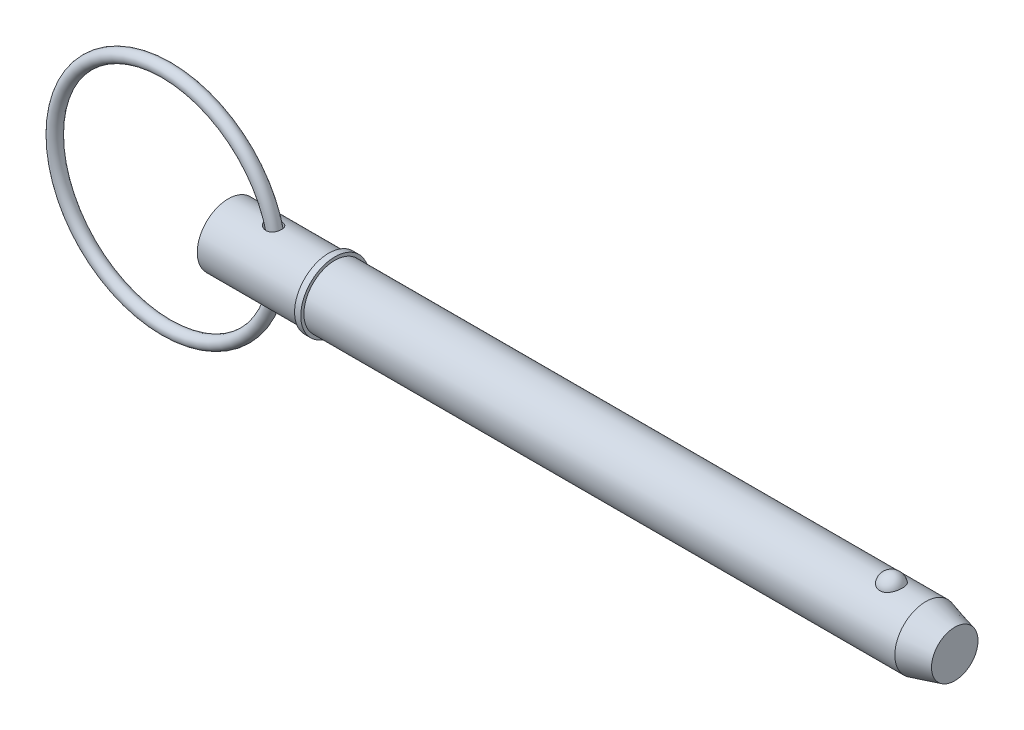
ISO-10303-21;
HEADER;
FILE_DESCRIPTION(('STEP AP214'),'2;1');
FILE_NAME('part.step','',(''),(''),'','','');
FILE_SCHEMA(('AUTOMOTIVE_DESIGN { 1 0 10303 214 1 1 1 1 }'));
ENDSEC;
DATA;
#1=APPLICATION_CONTEXT('core data for automotive mechanical design processes');
#2=APPLICATION_PROTOCOL_DEFINITION('international standard','automotive_design',2000,#1);
#3=PRODUCT_CONTEXT('',#1,'mechanical');
#4=PRODUCT('Part','Part','',(#3));
#5=PRODUCT_RELATED_PRODUCT_CATEGORY('part','',(#4));
#6=PRODUCT_DEFINITION_FORMATION('','',#4);
#7=PRODUCT_DEFINITION_CONTEXT('part definition',#1,'design');
#8=PRODUCT_DEFINITION('design','',#6,#7);
#9=PRODUCT_DEFINITION_SHAPE('','',#8);
#10=(LENGTH_UNIT() NAMED_UNIT(*) SI_UNIT(.MILLI.,.METRE.));
#11=(NAMED_UNIT(*) PLANE_ANGLE_UNIT() SI_UNIT($,.RADIAN.));
#12=(NAMED_UNIT(*) SI_UNIT($,.STERADIAN.) SOLID_ANGLE_UNIT());
#13=UNCERTAINTY_MEASURE_WITH_UNIT(LENGTH_MEASURE(1.E-05),#10,'distance_accuracy_value','');
#14=(GEOMETRIC_REPRESENTATION_CONTEXT(3) GLOBAL_UNCERTAINTY_ASSIGNED_CONTEXT((#13)) GLOBAL_UNIT_ASSIGNED_CONTEXT((#10,
#11,#12)) REPRESENTATION_CONTEXT('',''));
#15=CARTESIAN_POINT('',(0.,0.,0.));
#16=DIRECTION('',(0.,0.,1.));
#17=DIRECTION('',(1.,0.,0.));
#18=AXIS2_PLACEMENT_3D('',#15,#16,#17);
#19=CARTESIAN_POINT('',(-15.855506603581,0.,0.));
#20=DIRECTION('',(0.,0.,1.));
#21=DIRECTION('',(1.,0.,0.));
#22=AXIS2_PLACEMENT_3D('',#19,#20,#21);
#23=TOROIDAL_SURFACE('',#22,28.575,1.588);
#24=CARTESIAN_POINT('',(14.307493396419,0.,0.));
#25=VERTEX_POINT('',#24);
#26=VERTEX_LOOP('',#25);
#27=FACE_BOUND('',#26,.T.);
#28=ADVANCED_FACE('P0_F12',(#27),#23,.T.);
#29=CLOSED_SHELL('',(#28));
#30=MANIFOLD_SOLID_BREP('P0_B1',#29);
#31=CARTESIAN_POINT('',(0.,0.,0.));
#32=DIRECTION('',(1.,0.,0.));
#33=DIRECTION('',(0.,0.,-1.));
#34=AXIS2_PLACEMENT_3D('',#31,#32,#33);
#35=CYLINDRICAL_SURFACE('',#34,7.94);
#36=CARTESIAN_POINT('',(9.9064878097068,7.8609270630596,-1.11777712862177));
#37=CARTESIAN_POINT('',(9.98046148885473,7.84701054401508,-1.21564239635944));
#38=CARTESIAN_POINT('',(10.0632949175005,7.83217804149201,-1.30680329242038));
#39=CARTESIAN_POINT('',(10.243327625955,7.80247884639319,-1.47382688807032));
#40=CARTESIAN_POINT('',(10.3405572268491,7.78761214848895,-1.54965647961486));
#41=CARTESIAN_POINT('',(10.5460150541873,7.75960959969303,-1.6842723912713));
#42=CARTESIAN_POINT('',(10.654212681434,7.74646915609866,-1.74310445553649));
#43=CARTESIAN_POINT('',(10.8789333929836,7.72340979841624,-1.84259563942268));
#44=CARTESIAN_POINT('',(10.9954527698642,7.71348946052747,-1.88326279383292));
#45=CARTESIAN_POINT('',(11.2371543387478,7.69793327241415,-1.94589519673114));
#46=CARTESIAN_POINT('',(11.3624861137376,7.69242163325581,-1.96732022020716));
#47=CARTESIAN_POINT('',(11.6151110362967,7.68708151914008,-1.98809161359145));
#48=CARTESIAN_POINT('',(11.7424035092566,7.68725113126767,-1.98744541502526));
#49=CARTESIAN_POINT('',(11.9871377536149,7.69329740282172,-1.96389977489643));
#50=CARTESIAN_POINT('',(12.1047148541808,7.69883374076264,-1.94232728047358));
#51=CARTESIAN_POINT('',(12.3339179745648,7.7145667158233,-1.87886184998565));
#52=CARTESIAN_POINT('',(12.4455463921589,7.72476145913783,-1.83697717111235));
#53=CARTESIAN_POINT('',(12.6521036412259,7.74778151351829,-1.73721211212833));
#54=CARTESIAN_POINT('',(12.7476463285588,7.76039274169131,-1.68054854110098));
#55=CARTESIAN_POINT('',(12.9274536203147,7.78715828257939,-1.55179691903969));
#56=CARTESIAN_POINT('',(13.0117191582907,7.80131246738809,-1.47971014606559));
#57=CARTESIAN_POINT('',(13.16544092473,7.82932755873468,-1.32341211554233));
#58=CARTESIAN_POINT('',(13.2351086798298,7.84318958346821,-1.23940873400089));
#59=CARTESIAN_POINT('',(13.3595610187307,7.86933512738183,-1.06080152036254));
#60=CARTESIAN_POINT('',(13.4143450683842,7.88161858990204,-0.966197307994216));
#61=CARTESIAN_POINT('',(13.5082288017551,7.90340571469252,-0.767990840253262));
#62=CARTESIAN_POINT('',(13.5471601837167,7.91287927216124,-0.664305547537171));
#63=CARTESIAN_POINT('',(13.6076213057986,7.92785679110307,-0.451705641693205));
#64=CARTESIAN_POINT('',(13.6291504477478,7.93336061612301,-0.3427908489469));
#65=CARTESIAN_POINT('',(13.6544025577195,7.93983472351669,-0.122042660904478));
#66=CARTESIAN_POINT('',(13.6580055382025,7.94077445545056,-0.0101946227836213));
#67=CARTESIAN_POINT('',(13.6469977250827,7.93793630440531,0.212542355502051));
#68=CARTESIAN_POINT('',(13.6323866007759,7.93415833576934,0.323431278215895));
#69=CARTESIAN_POINT('',(13.5852649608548,7.92228583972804,0.541194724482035));
#70=CARTESIAN_POINT('',(13.5527398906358,7.91418780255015,0.648065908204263));
#71=CARTESIAN_POINT('',(13.4705326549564,7.8945509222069,0.854658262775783));
#72=CARTESIAN_POINT('',(13.4208502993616,7.88301204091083,0.954379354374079));
#73=CARTESIAN_POINT('',(13.3056021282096,7.85778224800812,1.14366619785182));
#74=CARTESIAN_POINT('',(13.2400609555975,7.8440946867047,1.23324739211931));
#75=CARTESIAN_POINT('',(13.0946981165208,7.8160855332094,1.39984119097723));
#76=CARTESIAN_POINT('',(13.0148777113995,7.80176399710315,1.47685490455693));
#77=CARTESIAN_POINT('',(12.8438529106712,7.774237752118,1.6154855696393));
#78=CARTESIAN_POINT('',(12.7527554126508,7.76102428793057,1.67723263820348));
#79=CARTESIAN_POINT('',(12.5611987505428,7.73705789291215,1.78453696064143));
#80=CARTESIAN_POINT('',(12.4607407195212,7.72630466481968,1.83009617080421));
#81=CARTESIAN_POINT('',(12.2541997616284,7.70849465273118,1.90371822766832));
#82=CARTESIAN_POINT('',(12.1481665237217,7.7014098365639,1.93191408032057));
#83=CARTESIAN_POINT('',(11.9327851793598,7.69148605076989,1.97105353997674));
#84=CARTESIAN_POINT('',(11.8234367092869,7.68864754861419,1.98199524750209));
#85=CARTESIAN_POINT('',(11.6016024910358,7.68735890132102,1.98698770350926));
#86=CARTESIAN_POINT('',(11.4891069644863,7.68902083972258,1.98060702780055));
#87=CARTESIAN_POINT('',(11.2665484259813,7.6966276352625,1.95083303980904));
#88=CARTESIAN_POINT('',(11.1564861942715,7.70257384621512,1.92743434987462));
#89=CARTESIAN_POINT('',(10.9339966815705,7.71853798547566,1.86251478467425));
#90=CARTESIAN_POINT('',(10.8219140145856,7.72880438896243,1.81987394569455));
#91=CARTESIAN_POINT('',(10.6060441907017,7.75216432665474,1.7176403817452));
#92=CARTESIAN_POINT('',(10.5022611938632,7.76525926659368,1.65803922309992));
#93=CARTESIAN_POINT('',(10.3000447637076,7.79362794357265,1.51929354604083));
#94=CARTESIAN_POINT('',(10.2022480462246,7.80898310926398,1.4392327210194));
#95=CARTESIAN_POINT('',(10.0221668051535,7.83939672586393,1.26310118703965));
#96=CARTESIAN_POINT('',(9.93988168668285,7.85445518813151,1.16703109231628));
#97=CARTESIAN_POINT('',(9.79729823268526,7.88178950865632,0.964874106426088));
#98=CARTESIAN_POINT('',(9.73627994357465,7.89414970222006,0.859310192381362));
#99=CARTESIAN_POINT('',(9.63554001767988,7.91508909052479,0.638143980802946));
#100=CARTESIAN_POINT('',(9.59578986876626,7.92367334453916,0.52255536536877));
#101=CARTESIAN_POINT('',(9.54388714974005,7.93499161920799,0.300466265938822));
#102=CARTESIAN_POINT('',(9.52888458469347,7.93832727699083,0.194660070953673));
#103=CARTESIAN_POINT('',(9.51823078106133,7.94068976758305,-0.0179747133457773));
#104=CARTESIAN_POINT('',(9.52257317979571,7.93971801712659,-0.124802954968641));
#105=CARTESIAN_POINT('',(9.54911264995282,7.93386114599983,-0.326814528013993));
#106=CARTESIAN_POINT('',(9.56976509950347,7.92931471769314,-0.422217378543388));
#107=CARTESIAN_POINT('',(9.62591284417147,7.91721462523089,-0.608271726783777));
#108=CARTESIAN_POINT('',(9.66139801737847,7.90966301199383,-0.698926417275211));
#109=CARTESIAN_POINT('',(9.7317197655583,7.89515389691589,-0.844763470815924));
#110=CARTESIAN_POINT('',(9.76292633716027,7.88881879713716,-0.90180107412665));
#111=CARTESIAN_POINT('',(9.83075962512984,7.87538342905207,-1.01244242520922));
#112=CARTESIAN_POINT('',(9.86738597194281,7.86828321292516,-1.06604640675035));
#113=CARTESIAN_POINT('',(9.9064878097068,7.8609270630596,-1.11777712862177));
#114=B_SPLINE_CURVE_WITH_KNOTS('',3,(#36,#37,#38,#39,#40,#41,#42,#43,#44,#45,#46,#47,#48,#49,
#50,#51,#52,#53,#54,#55,#56,#57,#58,#59,#60,#61,#62,#63,#64,#65,#66,#67,#68,#69,#70,#71,#72,#73,
#74,#75,#76,#77,#78,#79,#80,#81,#82,#83,#84,#85,#86,#87,#88,#89,#90,#91,#92,#93,#94,#95,#96,#97,
#98,#99,#100,#101,#102,#103,#104,#105,#106,#107,#108,#109,#110,#111,#112,#113),.UNSPECIFIED.,
.T.,.F.,(4,2,2,2,2,2,2,2,2,2,2,2,2,2,2,2,2,2,2,2,2,2,2,2,2,2,2,2,2,2,2,2,2,2,2,2,2,2,4),(0.,
0.370138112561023,0.741067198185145,1.11098852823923,1.48074607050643,1.86058657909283,
2.24029919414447,2.59740885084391,2.95437345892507,3.2881332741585,3.62186544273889,
3.95036374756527,4.27887384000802,4.61078596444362,4.94270949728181,5.27685177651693,
5.61100012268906,5.94542035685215,6.27984429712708,6.61375187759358,6.94762997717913,
7.27855592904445,7.60944187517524,7.93776058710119,8.26611544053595,8.60272268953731,
8.93943635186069,9.29895306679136,9.65864886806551,10.0387340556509,10.4188046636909,
10.7843533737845,11.1494107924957,11.4683925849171,11.7872694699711,12.0791172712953,
12.3707662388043,12.5664313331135,12.7620830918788),.UNSPECIFIED.);
#115=CARTESIAN_POINT('',(9.9064878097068,7.8609270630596,-1.11777712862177));
#116=VERTEX_POINT('',#115);
#117=EDGE_CURVE('P1_E42',#116,#116,#114,.T.);
#118=ORIENTED_EDGE('',*,*,#117,.T.);
#119=EDGE_LOOP('',(#118));
#120=FACE_BOUND('',#119,.T.);
#121=CARTESIAN_POINT('',(0.,0.,0.));
#122=DIRECTION('',(1.,0.,0.));
#123=DIRECTION('',(0.,0.,-1.));
#124=AXIS2_PLACEMENT_3D('',#121,#122,#123);
#125=CIRCLE('',#124,7.94);
#126=CARTESIAN_POINT('',(0.,0.,-7.94));
#127=VERTEX_POINT('',#126);
#128=EDGE_CURVE('P1_E9',#127,#127,#125,.T.);
#129=ORIENTED_EDGE('',*,*,#128,.T.);
#130=EDGE_LOOP('',(#129));
#131=FACE_BOUND('',#130,.T.);
#132=CARTESIAN_POINT('',(25.722,0.,0.));
#133=DIRECTION('',(1.,0.,0.));
#134=DIRECTION('',(0.,0.,-1.));
#135=AXIS2_PLACEMENT_3D('',#132,#133,#134);
#136=CIRCLE('',#135,7.94);
#137=CARTESIAN_POINT('',(25.722,0.,-7.94));
#138=VERTEX_POINT('',#137);
#139=EDGE_CURVE('P1_E25',#138,#138,#136,.T.);
#140=ORIENTED_EDGE('',*,*,#139,.F.);
#141=EDGE_LOOP('',(#140));
#142=FACE_BOUND('',#141,.T.);
#143=CARTESIAN_POINT('',(9.9064878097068,-7.8609270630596,-1.11777712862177));
#144=CARTESIAN_POINT('',(9.84378768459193,-7.87272256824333,-1.03482250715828));
#145=CARTESIAN_POINT('',(9.7874122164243,-7.88386682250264,-0.947002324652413));
#146=CARTESIAN_POINT('',(9.68947008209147,-7.90377389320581,-0.763202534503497));
#147=CARTESIAN_POINT('',(9.64789384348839,-7.91253824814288,-0.667228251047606));
#148=CARTESIAN_POINT('',(9.58141396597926,-7.92676779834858,-0.46889851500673));
#149=CARTESIAN_POINT('',(9.55658638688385,-7.93221793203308,-0.36651622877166));
#150=CARTESIAN_POINT('',(9.525398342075,-7.9390896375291,-0.158837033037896));
#151=CARTESIAN_POINT('',(9.51903196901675,-7.94051249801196,-0.0535410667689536));
#152=CARTESIAN_POINT('',(9.5249639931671,-7.93919670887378,0.149856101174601));
#153=CARTESIAN_POINT('',(9.53611757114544,-7.9367132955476,0.24799461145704));
#154=CARTESIAN_POINT('',(9.57435037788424,-7.92833496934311,0.44094918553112));
#155=CARTESIAN_POINT('',(9.60143086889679,-7.92243978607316,0.535764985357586));
#156=CARTESIAN_POINT('',(9.67027872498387,-7.90782830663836,0.720026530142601));
#157=CARTESIAN_POINT('',(9.71210005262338,-7.89910165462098,0.809451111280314));
#158=CARTESIAN_POINT('',(9.80864905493,-7.87966534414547,0.980775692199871));
#159=CARTESIAN_POINT('',(9.86338092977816,-7.86895504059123,1.06267323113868));
#160=CARTESIAN_POINT('',(9.99009906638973,-7.84531573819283,1.22559225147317));
#161=CARTESIAN_POINT('',(10.0632770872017,-7.8322718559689,1.30566871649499));
#162=CARTESIAN_POINT('',(10.2208237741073,-7.80611237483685,1.45392159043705));
#163=CARTESIAN_POINT('',(10.3051986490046,-7.79299674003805,1.52209134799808));
#164=CARTESIAN_POINT('',(10.4935539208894,-7.76638841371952,1.65280871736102));
#165=CARTESIAN_POINT('',(10.5986730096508,-7.75303312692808,1.71374951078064));
#166=CARTESIAN_POINT('',(10.8175805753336,-7.72920597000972,1.81820073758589));
#167=CARTESIAN_POINT('',(10.9313721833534,-7.71873514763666,1.86170483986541));
#168=CARTESIAN_POINT('',(11.1696833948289,-7.70161777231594,1.93133079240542));
#169=CARTESIAN_POINT('',(11.2944525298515,-7.69514907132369,1.95665138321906));
#170=CARTESIAN_POINT('',(11.5466607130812,-7.6877908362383,1.98537345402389));
#171=CARTESIAN_POINT('',(11.6740986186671,-7.68689896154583,1.98878412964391));
#172=CARTESIAN_POINT('',(11.9206005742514,-7.690938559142,1.97309854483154));
#173=CARTESIAN_POINT('',(12.0397453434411,-7.69555832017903,1.95520713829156));
#174=CARTESIAN_POINT('',(12.2727177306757,-7.70968728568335,1.89872693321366));
#175=CARTESIAN_POINT('',(12.3865475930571,-7.71919440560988,1.86014695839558));
#176=CARTESIAN_POINT('',(12.5975118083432,-7.74115679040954,1.76641559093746));
#177=CARTESIAN_POINT('',(12.6952552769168,-7.75336701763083,1.71257254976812));
#178=CARTESIAN_POINT('',(12.8798510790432,-7.77962828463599,1.58901145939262));
#179=CARTESIAN_POINT('',(12.9667044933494,-7.79367914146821,1.51929498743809));
#180=CARTESIAN_POINT('',(13.1254818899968,-7.82172079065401,1.36751778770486));
#181=CARTESIAN_POINT('',(13.1976693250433,-7.83570718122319,1.28573131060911));
#182=CARTESIAN_POINT('',(13.3274495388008,-7.86236718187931,1.11111271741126));
#183=CARTESIAN_POINT('',(13.3850418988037,-7.87504075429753,1.01828028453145));
#184=CARTESIAN_POINT('',(13.4847470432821,-7.89782512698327,0.823214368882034));
#185=CARTESIAN_POINT('',(13.5267056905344,-7.90791011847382,0.72089908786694));
#186=CARTESIAN_POINT('',(13.5933891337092,-7.92427335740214,0.510509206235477));
#187=CARTESIAN_POINT('',(13.6181132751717,-7.9305514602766,0.40243438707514));
#188=CARTESIAN_POINT('',(13.6498843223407,-7.93866355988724,0.182728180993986));
#189=CARTESIAN_POINT('',(13.6567982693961,-7.94046412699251,0.0710763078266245));
#190=CARTESIAN_POINT('',(13.6524060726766,-7.93933046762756,-0.151845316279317));
#191=CARTESIAN_POINT('',(13.6410996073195,-7.93639615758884,-0.263115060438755));
#192=CARTESIAN_POINT('',(13.6005023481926,-7.92610202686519,-0.482238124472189));
#193=CARTESIAN_POINT('',(13.571192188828,-7.91873744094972,-0.590087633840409));
#194=CARTESIAN_POINT('',(13.495246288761,-7.90037565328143,-0.799178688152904));
#195=CARTESIAN_POINT('',(13.4486102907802,-7.88937839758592,-0.900420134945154));
#196=CARTESIAN_POINT('',(13.3391817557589,-7.86497175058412,-1.09328280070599));
#197=CARTESIAN_POINT('',(13.2764083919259,-7.85156522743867,-1.18491525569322));
#198=CARTESIAN_POINT('',(13.1362355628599,-7.8238261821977,-1.35604994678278));
#199=CARTESIAN_POINT('',(13.0588372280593,-7.80949373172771,-1.43555311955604));
#200=CARTESIAN_POINT('',(12.8921392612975,-7.78164292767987,-1.57955181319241));
#201=CARTESIAN_POINT('',(12.8029410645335,-7.76811892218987,-1.64416363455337));
#202=CARTESIAN_POINT('',(12.6146622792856,-7.74328422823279,-1.75742016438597));
#203=CARTESIAN_POINT('',(12.5155829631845,-7.73197325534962,-1.80606692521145));
#204=CARTESIAN_POINT('',(12.31135301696,-7.71289290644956,-1.88588502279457));
#205=CARTESIAN_POINT('',(12.2062651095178,-7.70509254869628,-1.91720981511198));
#206=CARTESIAN_POINT('',(11.9922253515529,-7.69365188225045,-1.96261878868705));
#207=CARTESIAN_POINT('',(11.8832731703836,-7.69001193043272,-1.97670149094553));
#208=CARTESIAN_POINT('',(11.662174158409,-7.6871142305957,-1.98794112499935));
#209=CARTESIAN_POINT('',(11.5500082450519,-7.6879499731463,-1.98473694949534));
#210=CARTESIAN_POINT('',(11.3276038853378,-7.69396349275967,-1.96129119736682));
#211=CARTESIAN_POINT('',(11.2173659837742,-7.6991424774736,-1.94104488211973));
#212=CARTESIAN_POINT('',(10.9943151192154,-7.71363470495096,-1.8826578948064));
#213=CARTESIAN_POINT('',(10.8818004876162,-7.72319478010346,-1.8434396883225));
#214=CARTESIAN_POINT('',(10.6644693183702,-7.74534199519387,-1.74804607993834));
#215=CARTESIAN_POINT('',(10.5596578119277,-7.75793109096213,-1.69185971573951));
#216=CARTESIAN_POINT('',(10.3538333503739,-7.78563853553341,-1.55958016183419));
#217=CARTESIAN_POINT('',(10.2535123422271,-7.80086820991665,-1.48242881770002));
#218=CARTESIAN_POINT('',(10.0678634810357,-7.83136022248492,-1.31182139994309));
#219=CARTESIAN_POINT('',(9.98252491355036,-7.84662252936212,-1.21837707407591));
#220=CARTESIAN_POINT('',(9.9064878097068,-7.8609270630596,-1.11777712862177));
#221=B_SPLINE_CURVE_WITH_KNOTS('',3,(#143,#144,#145,#146,#147,#148,#149,#150,#151,#152,#153,
#154,#155,#156,#157,#158,#159,#160,#161,#162,#163,#164,#165,#166,#167,#168,#169,#170,#171,#172,
#173,#174,#175,#176,#177,#178,#179,#180,#181,#182,#183,#184,#185,#186,#187,#188,#189,#190,#191,
#192,#193,#194,#195,#196,#197,#198,#199,#200,#201,#202,#203,#204,#205,#206,#207,#208,#209,#210,
#211,#212,#213,#214,#215,#216,#217,#218,#219,#220),.UNSPECIFIED.,.T.,.F.,(4,2,2,2,2,2,2,2,2,2,2,
2,2,2,2,2,2,2,2,2,2,2,2,2,2,2,2,2,2,2,2,2,2,2,2,2,2,2,4),(0.,0.313593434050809,
0.626983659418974,0.941787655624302,1.25649090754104,1.55146990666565,1.84647228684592,
2.14256601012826,2.43875619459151,2.76521830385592,3.09186220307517,3.45696288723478,
3.82219601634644,4.20267276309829,4.58298981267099,4.94277962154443,5.30241610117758,
5.63754619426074,5.9726430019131,6.30104941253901,6.62946524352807,6.96103833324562,
7.29262401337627,7.62667800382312,7.96073789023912,8.29515773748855,8.62958255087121,
8.96361184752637,9.29761533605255,9.62891449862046,9.96017105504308,10.288443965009,
10.616745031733,10.951930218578,11.2872086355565,11.6442788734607,12.0015802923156,
12.3821516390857,12.762449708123),.UNSPECIFIED.);
#222=CARTESIAN_POINT('',(9.9064878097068,-7.8609270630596,-1.11777712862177));
#223=VERTEX_POINT('',#222);
#224=EDGE_CURVE('P1_E17',#223,#223,#221,.T.);
#225=ORIENTED_EDGE('',*,*,#224,.T.);
#226=EDGE_LOOP('',(#225));
#227=FACE_BOUND('',#226,.T.);
#228=ADVANCED_FACE('P1_F13',(#120,#131,#142,#227),#35,.T.);
#229=CARTESIAN_POINT('',(0.,0.,0.));
#230=DIRECTION('',(1.,0.,0.));
#231=DIRECTION('',(0.,0.,-1.));
#232=AXIS2_PLACEMENT_3D('',#229,#230,#231);
#233=CYLINDRICAL_SURFACE('',#232,7.94);
#234=CARTESIAN_POINT('',(178.651879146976,0.,0.));
#235=DIRECTION('',(1.,0.,0.));
#236=DIRECTION('',(0.,0.,-1.));
#237=AXIS2_PLACEMENT_3D('',#234,#235,#236);
#238=CIRCLE('',#237,7.94);
#239=CARTESIAN_POINT('',(178.651879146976,0.,-7.94));
#240=VERTEX_POINT('',#239);
#241=EDGE_CURVE('P1_E99',#240,#240,#238,.T.);
#242=ORIENTED_EDGE('',*,*,#241,.F.);
#243=EDGE_LOOP('',(#242));
#244=FACE_BOUND('',#243,.T.);
#245=CARTESIAN_POINT('',(27.31,0.,0.));
#246=DIRECTION('',(1.,0.,0.));
#247=DIRECTION('',(0.,0.,-1.));
#248=AXIS2_PLACEMENT_3D('',#245,#246,#247);
#249=CIRCLE('',#248,7.94);
#250=CARTESIAN_POINT('',(27.31,0.,-7.94));
#251=VERTEX_POINT('',#250);
#252=EDGE_CURVE('P1_E96',#251,#251,#249,.T.);
#253=ORIENTED_EDGE('',*,*,#252,.T.);
#254=EDGE_LOOP('',(#253));
#255=FACE_BOUND('',#254,.T.);
#256=CARTESIAN_POINT('',(169.844907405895,7.37767842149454,2.93486986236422));
#257=CARTESIAN_POINT('',(169.692749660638,7.3776732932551,2.93487505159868));
#258=CARTESIAN_POINT('',(169.540632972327,7.38258419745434,2.92262454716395));
#259=CARTESIAN_POINT('',(169.240928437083,7.40163229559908,2.87404196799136));
#260=CARTESIAN_POINT('',(169.093339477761,7.41576720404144,2.83771585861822));
#261=CARTESIAN_POINT('',(168.807018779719,7.4516157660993,2.74218769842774));
#262=CARTESIAN_POINT('',(168.668274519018,7.47331841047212,2.68301886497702));
#263=CARTESIAN_POINT('',(168.402882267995,7.52194082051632,2.54350967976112));
#264=CARTESIAN_POINT('',(168.276236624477,7.54886159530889,2.46316523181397));
#265=CARTESIAN_POINT('',(168.034534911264,7.60594671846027,2.28090375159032));
#266=CARTESIAN_POINT('',(167.919906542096,7.63618114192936,2.1784421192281));
#267=CARTESIAN_POINT('',(167.708878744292,7.69614046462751,1.95608495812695));
#268=CARTESIAN_POINT('',(167.612482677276,7.72586526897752,1.83618622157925));
#269=CARTESIAN_POINT('',(167.435938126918,7.78314821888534,1.57628086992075));
#270=CARTESIAN_POINT('',(167.356707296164,7.81055035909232,1.43561546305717));
#271=CARTESIAN_POINT('',(167.221797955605,7.85879631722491,1.142363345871));
#272=CARTESIAN_POINT('',(167.166121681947,7.87963951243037,0.989775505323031));
#273=CARTESIAN_POINT('',(167.07881215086,7.91289645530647,0.674619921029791));
#274=CARTESIAN_POINT('',(167.04753090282,7.92518652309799,0.511941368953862));
#275=CARTESIAN_POINT('',(167.010975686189,7.93958930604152,0.183247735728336));
#276=CARTESIAN_POINT('',(167.005701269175,7.94170219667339,0.0172327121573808));
#277=CARTESIAN_POINT('',(167.021231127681,7.93554931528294,-0.312672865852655));
#278=CARTESIAN_POINT('',(167.041925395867,7.92732732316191,-0.476569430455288));
#279=CARTESIAN_POINT('',(167.10878655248,7.90141534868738,-0.798305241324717));
#280=CARTESIAN_POINT('',(167.154953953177,7.88372517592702,-0.956144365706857));
#281=CARTESIAN_POINT('',(167.271898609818,7.84066230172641,-1.26152073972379));
#282=CARTESIAN_POINT('',(167.342704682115,7.81528060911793,-1.40904568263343));
#283=CARTESIAN_POINT('',(167.507478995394,7.75948672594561,-1.68950598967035));
#284=CARTESIAN_POINT('',(167.601448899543,7.72907417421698,-1.82244030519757));
#285=CARTESIAN_POINT('',(167.810839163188,7.66640424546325,-2.07032792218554));
#286=CARTESIAN_POINT('',(167.926315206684,7.63414223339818,-2.18523308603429));
#287=CARTESIAN_POINT('',(168.1759006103,7.57149681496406,-2.39329737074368));
#288=CARTESIAN_POINT('',(168.310008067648,7.54111321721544,-2.48645870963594));
#289=CARTESIAN_POINT('',(168.590111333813,7.48650742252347,-2.64628132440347));
#290=CARTESIAN_POINT('',(168.735760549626,7.46215900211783,-2.71350554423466));
#291=CARTESIAN_POINT('',(169.037425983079,7.42171253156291,-2.82226614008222));
#292=CARTESIAN_POINT('',(169.193438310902,7.40561140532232,-2.86381209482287));
#293=CARTESIAN_POINT('',(169.502970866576,7.3842679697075,-2.9183907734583));
#294=CARTESIAN_POINT('',(169.656222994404,7.37852109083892,-2.93275024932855));
#295=CARTESIAN_POINT('',(169.963070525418,7.37700973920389,-2.93655208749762));
#296=CARTESIAN_POINT('',(170.116665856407,7.38124333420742,-2.92599927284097));
#297=CARTESIAN_POINT('',(170.414990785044,7.39890635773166,-2.88102897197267));
#298=CARTESIAN_POINT('',(170.559848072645,7.41205491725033,-2.84733999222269));
#299=CARTESIAN_POINT('',(170.84164329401,7.445801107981,-2.75788206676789));
#300=CARTESIAN_POINT('',(170.978580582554,7.46639934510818,-2.70211132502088));
#301=CARTESIAN_POINT('',(171.244061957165,7.51339098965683,-2.56858908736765));
#302=CARTESIAN_POINT('',(171.372354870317,7.53990200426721,-2.4903806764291));
#303=CARTESIAN_POINT('',(171.614244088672,7.59569503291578,-2.31462737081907));
#304=CARTESIAN_POINT('',(171.727837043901,7.6249776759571,-2.21707808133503));
#305=CARTESIAN_POINT('',(171.94322156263,7.68489473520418,-1.99982049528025));
#306=CARTESIAN_POINT('',(172.044148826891,7.71552419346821,-1.87925337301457));
#307=CARTESIAN_POINT('',(172.225186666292,7.77353016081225,-1.6226882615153));
#308=CARTESIAN_POINT('',(172.305293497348,7.80090608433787,-1.48668750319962));
#309=CARTESIAN_POINT('',(172.445361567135,7.85047992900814,-1.1981841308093));
#310=CARTESIAN_POINT('',(172.504587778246,7.8724818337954,-1.04529016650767));
#311=CARTESIAN_POINT('',(172.597982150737,7.90785114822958,-0.731080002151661));
#312=CARTESIAN_POINT('',(172.632149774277,7.92121837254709,-0.569763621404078));
#313=CARTESIAN_POINT('',(172.674795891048,7.93797834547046,-0.242812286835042));
#314=CARTESIAN_POINT('',(172.683204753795,7.94134405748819,-0.0771668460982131));
#315=CARTESIAN_POINT('',(172.673962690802,7.93767937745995,0.253276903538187));
#316=CARTESIAN_POINT('',(172.656312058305,7.93064910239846,0.418075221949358));
#317=CARTESIAN_POINT('',(172.595424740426,7.90695571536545,0.741525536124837));
#318=CARTESIAN_POINT('',(172.552281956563,7.8903279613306,0.900197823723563));
#319=CARTESIAN_POINT('',(172.44135358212,7.84916386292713,1.20759654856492));
#320=CARTESIAN_POINT('',(172.37356656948,7.82462706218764,1.35632241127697));
#321=CARTESIAN_POINT('',(172.214371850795,7.7700669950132,1.64032869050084));
#322=CARTESIAN_POINT('',(172.122861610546,7.74002008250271,1.7755471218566));
#323=CARTESIAN_POINT('',(171.918296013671,7.67774175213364,2.0280064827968));
#324=CARTESIAN_POINT('',(171.805241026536,7.64551037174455,2.14524772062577));
#325=CARTESIAN_POINT('',(171.560831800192,7.58265895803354,2.35778002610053));
#326=CARTESIAN_POINT('',(171.429583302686,7.5520309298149,2.45319004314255));
#327=CARTESIAN_POINT('',(171.151601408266,7.49579792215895,2.61999897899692));
#328=CARTESIAN_POINT('',(171.004867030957,7.4701932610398,2.69139637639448));
#329=CARTESIAN_POINT('',(170.692947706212,7.42622216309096,2.81053241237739));
#330=CARTESIAN_POINT('',(170.527220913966,7.40825002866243,2.85700910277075));
#331=CARTESIAN_POINT('',(170.189279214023,7.38398348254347,2.9191685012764));
#332=CARTESIAN_POINT('',(170.01706702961,7.3776842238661,2.93486399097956));
#333=CARTESIAN_POINT('',(169.844907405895,7.37767842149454,2.93486986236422));
#334=B_SPLINE_CURVE_WITH_KNOTS('',3,(#256,#257,#258,#259,#260,#261,#262,#263,#264,#265,#266,
#267,#268,#269,#270,#271,#272,#273,#274,#275,#276,#277,#278,#279,#280,#281,#282,#283,#284,#285,
#286,#287,#288,#289,#290,#291,#292,#293,#294,#295,#296,#297,#298,#299,#300,#301,#302,#303,#304,
#305,#306,#307,#308,#309,#310,#311,#312,#313,#314,#315,#316,#317,#318,#319,#320,#321,#322,#323,
#324,#325,#326,#327,#328,#329,#330,#331,#332,#333),.UNSPECIFIED.,.T.,.F.,(4,2,2,2,2,2,2,2,2,2,2,
2,2,2,2,2,2,2,2,2,2,2,2,2,2,2,2,2,2,2,2,2,2,2,2,2,2,2,4),(0.,0.455841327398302,
0.911569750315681,1.36663794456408,1.82179423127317,2.2897898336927,2.75787163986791,
3.24685368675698,3.73588214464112,4.23184282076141,4.72779494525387,5.22165321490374,
5.71552141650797,6.20996917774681,6.70445245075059,7.20023431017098,7.6959655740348,
8.18023418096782,8.66432203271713,9.1241069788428,9.58380291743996,10.0296503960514,
10.4755341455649,10.9312349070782,11.3870393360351,11.8654416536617,12.3439299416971,
12.8378875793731,13.3318558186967,13.8271581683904,14.3224549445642,14.8159385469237,
15.3094506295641,15.8051323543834,16.3008055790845,16.7937101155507,17.2866458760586,
17.8026240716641,18.3183879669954),.UNSPECIFIED.);
#335=CARTESIAN_POINT('',(169.844907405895,7.37767842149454,2.93486986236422));
#336=VERTEX_POINT('',#335);
#337=EDGE_CURVE('P1_E34',#336,#336,#334,.T.);
#338=ORIENTED_EDGE('',*,*,#337,.T.);
#339=EDGE_LOOP('',(#338));
#340=FACE_BOUND('',#339,.T.);
#341=ADVANCED_FACE('P1_F46',(#244,#255,#340),#233,.T.);
#342=CARTESIAN_POINT('',(0.,0.,0.));
#343=DIRECTION('',(-1.,0.,0.));
#344=DIRECTION('',(0.,0.,1.));
#345=AXIS2_PLACEMENT_3D('',#342,#343,#344);
#346=PLANE('',#345);
#347=ORIENTED_EDGE('',*,*,#128,.F.);
#348=EDGE_LOOP('',(#347));
#349=FACE_BOUND('',#348,.T.);
#350=ADVANCED_FACE('P1_F15',(#349),#346,.T.);
#351=CARTESIAN_POINT('',(25.722,7.94,0.));
#352=DIRECTION('',(-1.,0.,0.));
#353=DIRECTION('',(0.,0.,1.));
#354=AXIS2_PLACEMENT_3D('',#351,#352,#353);
#355=PLANE('',#354);
#356=ORIENTED_EDGE('',*,*,#139,.T.);
#357=EDGE_LOOP('',(#356));
#358=FACE_BOUND('',#357,.T.);
#359=CARTESIAN_POINT('',(25.722,0.,0.));
#360=DIRECTION('',(1.,0.,0.));
#361=DIRECTION('',(0.,0.,-1.));
#362=AXIS2_PLACEMENT_3D('',#359,#360,#361);
#363=CIRCLE('',#362,8.734);
#364=CARTESIAN_POINT('',(25.722,0.,-8.734));
#365=VERTEX_POINT('',#364);
#366=EDGE_CURVE('P1_E30',#365,#365,#363,.T.);
#367=ORIENTED_EDGE('',*,*,#366,.F.);
#368=EDGE_LOOP('',(#367));
#369=FACE_BOUND('',#368,.T.);
#370=ADVANCED_FACE('P1_F81',(#358,#369),#355,.T.);
#371=CARTESIAN_POINT('',(0.,0.,0.));
#372=DIRECTION('',(1.,0.,0.));
#373=DIRECTION('',(0.,0.,-1.));
#374=AXIS2_PLACEMENT_3D('',#371,#372,#373);
#375=CYLINDRICAL_SURFACE('',#374,8.734);
#376=ORIENTED_EDGE('',*,*,#366,.T.);
#377=EDGE_LOOP('',(#376));
#378=FACE_BOUND('',#377,.T.);
#379=CARTESIAN_POINT('',(27.31,0.,0.));
#380=DIRECTION('',(1.,0.,0.));
#381=DIRECTION('',(0.,0.,-1.));
#382=AXIS2_PLACEMENT_3D('',#379,#380,#381);
#383=CIRCLE('',#382,8.734);
#384=CARTESIAN_POINT('',(27.31,0.,-8.734));
#385=VERTEX_POINT('',#384);
#386=EDGE_CURVE('P1_E95',#385,#385,#383,.T.);
#387=ORIENTED_EDGE('',*,*,#386,.F.);
#388=EDGE_LOOP('',(#387));
#389=FACE_BOUND('',#388,.T.);
#390=ADVANCED_FACE('P1_F68',(#378,#389),#375,.T.);
#391=CARTESIAN_POINT('',(27.31,8.734,0.));
#392=DIRECTION('',(1.,0.,0.));
#393=DIRECTION('',(0.,0.,-1.));
#394=AXIS2_PLACEMENT_3D('',#391,#392,#393);
#395=PLANE('',#394);
#396=ORIENTED_EDGE('',*,*,#386,.T.);
#397=EDGE_LOOP('',(#396));
#398=FACE_BOUND('',#397,.T.);
#399=ORIENTED_EDGE('',*,*,#252,.F.);
#400=EDGE_LOOP('',(#399));
#401=FACE_BOUND('',#400,.T.);
#402=ADVANCED_FACE('P1_F62',(#398,#401),#395,.T.);
#403=CARTESIAN_POINT('',(186.06,0.,0.));
#404=DIRECTION('',(-1.,0.,0.));
#405=DIRECTION('',(0.,0.,1.));
#406=AXIS2_PLACEMENT_3D('',#403,#404,#405);
#407=CONICAL_SURFACE('',#406,5.95500000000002,0.261799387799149);
#408=ORIENTED_EDGE('',*,*,#241,.T.);
#409=EDGE_LOOP('',(#408));
#410=FACE_BOUND('',#409,.T.);
#411=CARTESIAN_POINT('',(186.06,0.,0.));
#412=DIRECTION('',(1.,0.,0.));
#413=DIRECTION('',(0.,0.,-1.));
#414=AXIS2_PLACEMENT_3D('',#411,#412,#413);
#415=CIRCLE('',#414,5.95500000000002);
#416=CARTESIAN_POINT('',(186.06,0.,-5.95500000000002));
#417=VERTEX_POINT('',#416);
#418=EDGE_CURVE('P1_E41',#417,#417,#415,.T.);
#419=ORIENTED_EDGE('',*,*,#418,.F.);
#420=EDGE_LOOP('',(#419));
#421=FACE_BOUND('',#420,.T.);
#422=ADVANCED_FACE('P1_F59',(#410,#421),#407,.T.);
#423=CARTESIAN_POINT('',(186.06,5.95500000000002,0.));
#424=DIRECTION('',(1.,0.,0.));
#425=DIRECTION('',(0.,0.,-1.));
#426=AXIS2_PLACEMENT_3D('',#423,#424,#425);
#427=PLANE('',#426);
#428=ORIENTED_EDGE('',*,*,#418,.T.);
#429=EDGE_LOOP('',(#428));
#430=FACE_BOUND('',#429,.T.);
#431=ADVANCED_FACE('P1_F55',(#430),#427,.T.);
#432=CARTESIAN_POINT('',(169.844907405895,7.14599999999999,0.));
#433=DIRECTION('',(-1.,0.,0.));
#434=DIRECTION('',(0.,-1.,0.));
#435=AXIS2_PLACEMENT_3D('',#432,#433,#434);
#436=SPHERICAL_SURFACE('',#435,2.944);
#437=ORIENTED_EDGE('',*,*,#337,.F.);
#438=EDGE_LOOP('',(#437));
#439=FACE_BOUND('',#438,.T.);
#440=ADVANCED_FACE('P1_F50',(#439),#436,.T.);
#441=CARTESIAN_POINT('',(-15.855506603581,0.,0.));
#442=DIRECTION('',(0.,0.,1.));
#443=DIRECTION('',(1.,0.,0.));
#444=AXIS2_PLACEMENT_3D('',#441,#442,#443);
#445=TOROIDAL_SURFACE('',#444,28.575,1.985);
#446=ORIENTED_EDGE('',*,*,#224,.F.);
#447=EDGE_LOOP('',(#446));
#448=FACE_BOUND('',#447,.T.);
#449=ORIENTED_EDGE('',*,*,#117,.F.);
#450=EDGE_LOOP('',(#449));
#451=FACE_BOUND('',#450,.T.);
#452=ADVANCED_FACE('P1_F54',(#448,#451),#445,.F.);
#453=CLOSED_SHELL('',(#228,#341,#350,#370,#390,#402,#422,#431,#440,#452));
#454=MANIFOLD_SOLID_BREP('P1_B1',#453);
#455=ADVANCED_BREP_SHAPE_REPRESENTATION('',(#18,#30,#454),#14);
#456=SHAPE_DEFINITION_REPRESENTATION(#9,#455);
ENDSEC;
END-ISO-10303-21;
